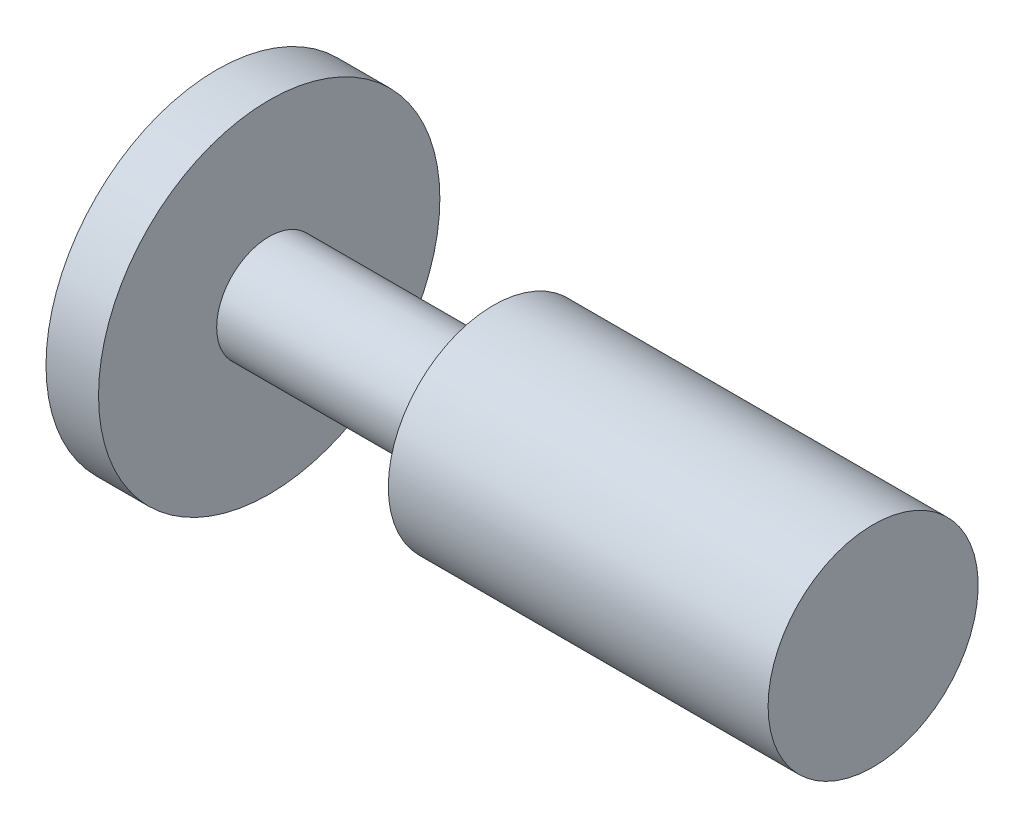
from build123d import *


with BuildPart() as part:
    # Esquisse1 → R_volution1 (revolve)
    with BuildSketch(Plane.XY, mode=Mode.PRIVATE) as r_volution1_sk:
        Polygon((0, 0), (0, 32.5), (10, 32.5), (10, 10), (50, 10), (52.679491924, 20), (125, 20), (125, 0), align=None)
    revolve(r_volution1_sk.sketch.rotate(Axis((-18.055301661, 0, 0), (1, 0, 0)), 90), axis=Axis((-18.055301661, 0, 0), (1, 0, 0)))


solid = part.part
